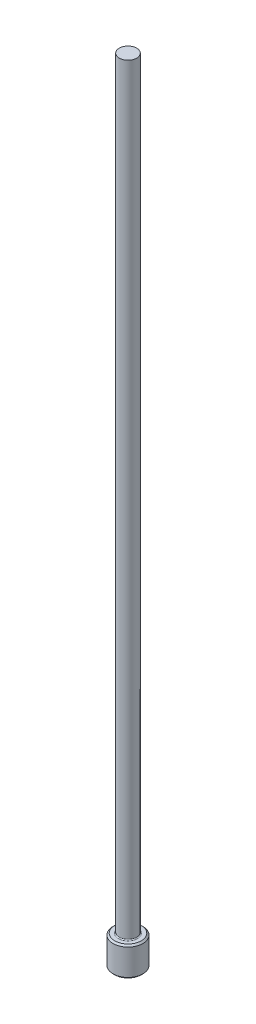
ISO-10303-21;
HEADER;
FILE_DESCRIPTION(('STEP AP214'),'2;1');
FILE_NAME('part.step','',(''),(''),'','','');
FILE_SCHEMA(('AUTOMOTIVE_DESIGN { 1 0 10303 214 1 1 1 1 }'));
ENDSEC;
DATA;
#1=APPLICATION_CONTEXT('core data for automotive mechanical design processes');
#2=APPLICATION_PROTOCOL_DEFINITION('international standard','automotive_design',2000,#1);
#3=PRODUCT_CONTEXT('',#1,'mechanical');
#4=PRODUCT('Part','Part','',(#3));
#5=PRODUCT_RELATED_PRODUCT_CATEGORY('part','',(#4));
#6=PRODUCT_DEFINITION_FORMATION('','',#4);
#7=PRODUCT_DEFINITION_CONTEXT('part definition',#1,'design');
#8=PRODUCT_DEFINITION('design','',#6,#7);
#9=PRODUCT_DEFINITION_SHAPE('','',#8);
#10=(LENGTH_UNIT() NAMED_UNIT(*) SI_UNIT(.MILLI.,.METRE.));
#11=(NAMED_UNIT(*) PLANE_ANGLE_UNIT() SI_UNIT($,.RADIAN.));
#12=(NAMED_UNIT(*) SI_UNIT($,.STERADIAN.) SOLID_ANGLE_UNIT());
#13=UNCERTAINTY_MEASURE_WITH_UNIT(LENGTH_MEASURE(1.E-05),#10,'distance_accuracy_value','');
#14=(GEOMETRIC_REPRESENTATION_CONTEXT(3) GLOBAL_UNCERTAINTY_ASSIGNED_CONTEXT((#13)) GLOBAL_UNIT_ASSIGNED_CONTEXT((#10,
#11,#12)) REPRESENTATION_CONTEXT('',''));
#15=CARTESIAN_POINT('',(0.,0.,0.));
#16=DIRECTION('',(0.,0.,1.));
#17=DIRECTION('',(1.,0.,0.));
#18=AXIS2_PLACEMENT_3D('',#15,#16,#17);
#19=CARTESIAN_POINT('',(0.,0.,0.));
#20=DIRECTION('',(0.,-1.,0.));
#21=DIRECTION('',(0.,0.,-1.));
#22=AXIS2_PLACEMENT_3D('',#19,#20,#21);
#23=PLANE('',#22);
#24=CARTESIAN_POINT('',(0.,0.,0.));
#25=DIRECTION('',(0.,-1.,0.));
#26=DIRECTION('',(0.,0.,-1.));
#27=AXIS2_PLACEMENT_3D('',#24,#25,#26);
#28=CIRCLE('',#27,1.06679999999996);
#29=CARTESIAN_POINT('',(0.,0.,-1.06679999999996));
#30=VERTEX_POINT('',#29);
#31=EDGE_CURVE('E46',#30,#30,#28,.T.);
#32=ORIENTED_EDGE('',*,*,#31,.T.);
#33=EDGE_LOOP('',(#32));
#34=FACE_BOUND('',#33,.T.);
#35=ADVANCED_FACE('F35',(#34),#23,.T.);
#36=CARTESIAN_POINT('',(0.,259.958771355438,0.));
#37=DIRECTION('',(0.,1.,0.));
#38=DIRECTION('',(0.,0.,1.));
#39=AXIS2_PLACEMENT_3D('',#36,#37,#38);
#40=CYLINDRICAL_SURFACE('',#39,1.19379999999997);
#41=CARTESIAN_POINT('',(0.,2.23519999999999,0.));
#42=DIRECTION('',(0.,1.,0.));
#43=DIRECTION('',(0.,0.,1.));
#44=AXIS2_PLACEMENT_3D('',#41,#42,#43);
#45=CIRCLE('',#44,1.19379999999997);
#46=CARTESIAN_POINT('',(0.,2.23519999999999,1.19379999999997));
#47=VERTEX_POINT('',#46);
#48=EDGE_CURVE('E50',#47,#47,#45,.F.);
#49=ORIENTED_EDGE('',*,*,#48,.T.);
#50=EDGE_LOOP('',(#49));
#51=FACE_BOUND('',#50,.T.);
#52=CARTESIAN_POINT('',(0.,0.126999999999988,0.));
#53=DIRECTION('',(0.,-1.,0.));
#54=DIRECTION('',(0.,0.,-1.));
#55=AXIS2_PLACEMENT_3D('',#52,#53,#54);
#56=CIRCLE('',#55,1.19379999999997);
#57=CARTESIAN_POINT('',(0.,0.126999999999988,-1.19379999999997));
#58=VERTEX_POINT('',#57);
#59=EDGE_CURVE('E55',#58,#58,#56,.F.);
#60=ORIENTED_EDGE('',*,*,#59,.T.);
#61=EDGE_LOOP('',(#60));
#62=FACE_BOUND('',#61,.T.);
#63=ADVANCED_FACE('F77',(#51,#62),#40,.T.);
#64=CARTESIAN_POINT('',(-1.19379999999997,2.3622,0.));
#65=DIRECTION('',(0.,1.,0.));
#66=DIRECTION('',(0.,0.,1.));
#67=AXIS2_PLACEMENT_3D('',#64,#65,#66);
#68=PLANE('',#67);
#69=CARTESIAN_POINT('',(0.,2.3622,0.));
#70=DIRECTION('',(0.,1.,0.));
#71=DIRECTION('',(0.,0.,1.));
#72=AXIS2_PLACEMENT_3D('',#69,#70,#71);
#73=CIRCLE('',#72,0.774699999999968);
#74=CARTESIAN_POINT('',(0.,2.3622,0.774699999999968));
#75=VERTEX_POINT('',#74);
#76=EDGE_CURVE('E10',#75,#75,#73,.F.);
#77=ORIENTED_EDGE('',*,*,#76,.T.);
#78=EDGE_LOOP('',(#77));
#79=FACE_BOUND('',#78,.T.);
#80=CARTESIAN_POINT('',(0.,2.3622,0.));
#81=DIRECTION('',(0.,1.,0.));
#82=DIRECTION('',(0.,0.,1.));
#83=AXIS2_PLACEMENT_3D('',#80,#81,#82);
#84=CIRCLE('',#83,1.06679999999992);
#85=CARTESIAN_POINT('',(0.,2.3622,1.06679999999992));
#86=VERTEX_POINT('',#85);
#87=EDGE_CURVE('E58',#86,#86,#84,.T.);
#88=ORIENTED_EDGE('',*,*,#87,.T.);
#89=EDGE_LOOP('',(#88));
#90=FACE_BOUND('',#89,.T.);
#91=ADVANCED_FACE('F69',(#79,#90),#68,.T.);
#92=CARTESIAN_POINT('',(0.,259.958771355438,0.));
#93=DIRECTION('',(0.,1.,0.));
#94=DIRECTION('',(0.,0.,1.));
#95=AXIS2_PLACEMENT_3D('',#92,#93,#94);
#96=CYLINDRICAL_SURFACE('',#95,0.698499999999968);
#97=CARTESIAN_POINT('',(0.,2.43840000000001,0.));
#98=DIRECTION('',(0.,1.,0.));
#99=DIRECTION('',(0.,0.,1.));
#100=AXIS2_PLACEMENT_3D('',#97,#98,#99);
#101=CIRCLE('',#100,0.698499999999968);
#102=CARTESIAN_POINT('',(0.,2.43840000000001,0.698499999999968));
#103=VERTEX_POINT('',#102);
#104=EDGE_CURVE('E42',#103,#103,#101,.T.);
#105=ORIENTED_EDGE('',*,*,#104,.T.);
#106=EDGE_LOOP('',(#105));
#107=FACE_BOUND('',#106,.T.);
#108=CARTESIAN_POINT('',(0.,63.5,0.));
#109=DIRECTION('',(0.,1.,0.));
#110=DIRECTION('',(0.,0.,1.));
#111=AXIS2_PLACEMENT_3D('',#108,#109,#110);
#112=CIRCLE('',#111,0.698499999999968);
#113=CARTESIAN_POINT('',(0.,63.5,0.698499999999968));
#114=VERTEX_POINT('',#113);
#115=EDGE_CURVE('E61',#114,#114,#112,.T.);
#116=ORIENTED_EDGE('',*,*,#115,.F.);
#117=EDGE_LOOP('',(#116));
#118=FACE_BOUND('',#117,.T.);
#119=ADVANCED_FACE('F67',(#107,#118),#96,.T.);
#120=CARTESIAN_POINT('',(-0.698499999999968,63.5,0.));
#121=DIRECTION('',(0.,1.,0.));
#122=DIRECTION('',(0.,0.,1.));
#123=AXIS2_PLACEMENT_3D('',#120,#121,#122);
#124=PLANE('',#123);
#125=ORIENTED_EDGE('',*,*,#115,.T.);
#126=EDGE_LOOP('',(#125));
#127=FACE_BOUND('',#126,.T.);
#128=ADVANCED_FACE('F65',(#127),#124,.T.);
#129=CARTESIAN_POINT('',(0.,2.36219999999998,0.));
#130=DIRECTION('',(0.,-1.,0.));
#131=DIRECTION('',(0.,0.,-1.));
#132=AXIS2_PLACEMENT_3D('',#129,#130,#131);
#133=CONICAL_SURFACE('',#132,1.06679999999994,0.785398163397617);
#134=ORIENTED_EDGE('',*,*,#48,.F.);
#135=EDGE_LOOP('',(#134));
#136=FACE_BOUND('',#135,.T.);
#137=ORIENTED_EDGE('',*,*,#87,.F.);
#138=EDGE_LOOP('',(#137));
#139=FACE_BOUND('',#138,.T.);
#140=ADVANCED_FACE('F75',(#136,#139),#133,.T.);
#141=CARTESIAN_POINT('',(0.,0.126999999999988,0.));
#142=DIRECTION('',(0.,1.,0.));
#143=DIRECTION('',(0.,0.,1.));
#144=AXIS2_PLACEMENT_3D('',#141,#142,#143);
#145=CONICAL_SURFACE('',#144,1.19379999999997,0.785398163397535);
#146=ORIENTED_EDGE('',*,*,#31,.F.);
#147=EDGE_LOOP('',(#146));
#148=FACE_BOUND('',#147,.T.);
#149=ORIENTED_EDGE('',*,*,#59,.F.);
#150=EDGE_LOOP('',(#149));
#151=FACE_BOUND('',#150,.T.);
#152=ADVANCED_FACE('F89',(#148,#151),#145,.T.);
#153=CARTESIAN_POINT('',(0.,2.43840000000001,0.));
#154=DIRECTION('',(0.,1.,0.));
#155=DIRECTION('',(0.,0.,1.));
#156=AXIS2_PLACEMENT_3D('',#153,#154,#155);
#157=TOROIDAL_SURFACE('',#156,0.774699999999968,0.0762);
#158=ORIENTED_EDGE('',*,*,#76,.F.);
#159=EDGE_LOOP('',(#158));
#160=FACE_BOUND('',#159,.T.);
#161=ORIENTED_EDGE('',*,*,#104,.F.);
#162=EDGE_LOOP('',(#161));
#163=FACE_BOUND('',#162,.T.);
#164=ADVANCED_FACE('F37',(#160,#163),#157,.F.);
#165=CLOSED_SHELL('',(#35,#63,#91,#119,#128,#140,#152,#164));
#166=MANIFOLD_SOLID_BREP('B2',#165);
#167=ADVANCED_BREP_SHAPE_REPRESENTATION('',(#18,#166),#14);
#168=SHAPE_DEFINITION_REPRESENTATION(#9,#167);
ENDSEC;
END-ISO-10303-21;
